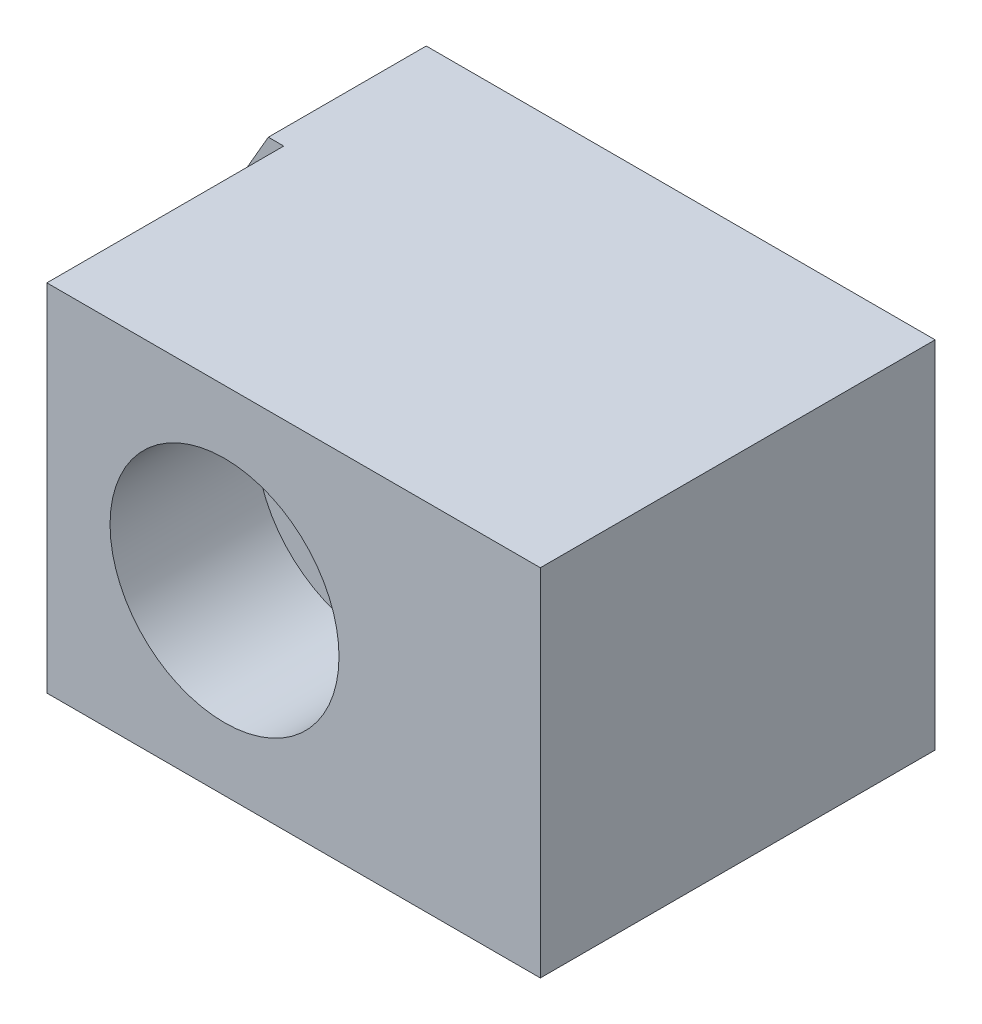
ISO-10303-21;
HEADER;
FILE_DESCRIPTION(('STEP AP214'),'2;1');
FILE_NAME('part.step','',(''),(''),'','','');
FILE_SCHEMA(('AUTOMOTIVE_DESIGN { 1 0 10303 214 1 1 1 1 }'));
ENDSEC;
DATA;
#1=APPLICATION_CONTEXT('core data for automotive mechanical design processes');
#2=APPLICATION_PROTOCOL_DEFINITION('international standard','automotive_design',2000,#1);
#3=PRODUCT_CONTEXT('',#1,'mechanical');
#4=PRODUCT('Part','Part','',(#3));
#5=PRODUCT_RELATED_PRODUCT_CATEGORY('part','',(#4));
#6=PRODUCT_DEFINITION_FORMATION('','',#4);
#7=PRODUCT_DEFINITION_CONTEXT('part definition',#1,'design');
#8=PRODUCT_DEFINITION('design','',#6,#7);
#9=PRODUCT_DEFINITION_SHAPE('','',#8);
#10=(LENGTH_UNIT() NAMED_UNIT(*) SI_UNIT(.MILLI.,.METRE.));
#11=(NAMED_UNIT(*) PLANE_ANGLE_UNIT() SI_UNIT($,.RADIAN.));
#12=(NAMED_UNIT(*) SI_UNIT($,.STERADIAN.) SOLID_ANGLE_UNIT());
#13=UNCERTAINTY_MEASURE_WITH_UNIT(LENGTH_MEASURE(1.E-05),#10,'distance_accuracy_value','');
#14=(GEOMETRIC_REPRESENTATION_CONTEXT(3) GLOBAL_UNCERTAINTY_ASSIGNED_CONTEXT((#13)) GLOBAL_UNIT_ASSIGNED_CONTEXT((#10,
#11,#12)) REPRESENTATION_CONTEXT('',''));
#15=CARTESIAN_POINT('',(0.,0.,0.));
#16=DIRECTION('',(0.,0.,1.));
#17=DIRECTION('',(1.,0.,0.));
#18=AXIS2_PLACEMENT_3D('',#15,#16,#17);
#19=CARTESIAN_POINT('',(-15.2000000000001,0.499999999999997,9.99999999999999));
#20=DIRECTION('',(0.86602540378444,-0.500000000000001,0.));
#21=DIRECTION('',(0.500000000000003,0.866025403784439,0.));
#22=AXIS2_PLACEMENT_3D('',#19,#20,#21);
#23=PLANE('',#22);
#24=DIRECTION('',(-0.500000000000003,-0.866025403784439,0.));
#25=VECTOR('',#24,1.);
#26=CARTESIAN_POINT('',(-12.5000000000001,5.17653718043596,4.));
#27=LINE('',#26,#25);
#28=CARTESIAN_POINT('',(-12.8905989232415,4.49999999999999,4.));
#29=VERTEX_POINT('',#28);
#30=CARTESIAN_POINT('',(-15.2000000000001,0.499999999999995,4.));
#31=VERTEX_POINT('',#30);
#32=EDGE_CURVE('E421',#29,#31,#27,.T.);
#33=ORIENTED_EDGE('',*,*,#32,.F.);
#34=DIRECTION('',(0.,0.,-1.));
#35=VECTOR('',#34,1.);
#36=CARTESIAN_POINT('',(-12.8905989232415,4.5,10.));
#37=LINE('',#36,#35);
#38=CARTESIAN_POINT('',(-12.8905989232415,4.5,0.));
#39=VERTEX_POINT('',#38);
#40=EDGE_CURVE('E442',#29,#39,#37,.T.);
#41=ORIENTED_EDGE('',*,*,#40,.T.);
#42=DIRECTION('',(-0.500000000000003,-0.866025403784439,0.));
#43=VECTOR('',#42,1.);
#44=CARTESIAN_POINT('',(-15.2000000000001,0.499999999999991,0.));
#45=LINE('',#44,#43);
#46=CARTESIAN_POINT('',(-15.2000000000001,0.499999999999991,0.));
#47=VERTEX_POINT('',#46);
#48=EDGE_CURVE('E485',#39,#47,#45,.T.);
#49=ORIENTED_EDGE('',*,*,#48,.T.);
#50=DIRECTION('',(0.,0.,-1.));
#51=VECTOR('',#50,1.);
#52=CARTESIAN_POINT('',(-15.2000000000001,0.499999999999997,9.99999999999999));
#53=LINE('',#52,#51);
#54=EDGE_CURVE('E440',#31,#47,#53,.T.);
#55=ORIENTED_EDGE('',*,*,#54,.F.);
#56=EDGE_LOOP('',(#33,#41,#49,#55));
#57=FACE_BOUND('',#56,.T.);
#58=ADVANCED_FACE('F350',(#57),#23,.F.);
#59=CARTESIAN_POINT('',(-15.2000000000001,-0.500000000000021,10.));
#60=DIRECTION('',(1.,0.,0.));
#61=DIRECTION('',(0.,0.,-1.));
#62=AXIS2_PLACEMENT_3D('',#59,#60,#61);
#63=PLANE('',#62);
#64=DIRECTION('',(0.,-1.,0.));
#65=VECTOR('',#64,1.);
#66=CARTESIAN_POINT('',(-15.2000000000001,0.499999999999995,4.));
#67=LINE('',#66,#65);
#68=CARTESIAN_POINT('',(-15.2000000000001,-0.500000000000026,4.00000000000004));
#69=VERTEX_POINT('',#68);
#70=EDGE_CURVE('E415',#31,#69,#67,.T.);
#71=ORIENTED_EDGE('',*,*,#70,.F.);
#72=ORIENTED_EDGE('',*,*,#54,.T.);
#73=DIRECTION('',(0.,-1.,0.));
#74=VECTOR('',#73,1.);
#75=CARTESIAN_POINT('',(-15.2,-0.500000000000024,0.));
#76=LINE('',#75,#74);
#77=CARTESIAN_POINT('',(-15.2,-0.500000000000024,0.));
#78=VERTEX_POINT('',#77);
#79=EDGE_CURVE('E438',#47,#78,#76,.T.);
#80=ORIENTED_EDGE('',*,*,#79,.T.);
#81=DIRECTION('',(0.,0.,-1.));
#82=VECTOR('',#81,1.);
#83=CARTESIAN_POINT('',(-15.2000000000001,-0.500000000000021,10.));
#84=LINE('',#83,#82);
#85=EDGE_CURVE('E431',#69,#78,#84,.T.);
#86=ORIENTED_EDGE('',*,*,#85,.F.);
#87=EDGE_LOOP('',(#71,#72,#80,#86));
#88=FACE_BOUND('',#87,.T.);
#89=ADVANCED_FACE('F436',(#88),#63,.F.);
#90=CARTESIAN_POINT('',(-12.8905989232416,-4.50000000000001,9.99999999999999));
#91=DIRECTION('',(0.866025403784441,0.500000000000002,0.));
#92=DIRECTION('',(-0.500000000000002,0.866025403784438,0.));
#93=AXIS2_PLACEMENT_3D('',#90,#91,#92);
#94=PLANE('',#93);
#95=DIRECTION('',(0.500000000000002,-0.866025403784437,0.));
#96=VECTOR('',#95,1.);
#97=CARTESIAN_POINT('',(-15.2000000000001,-0.500000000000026,4.00000000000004));
#98=LINE('',#97,#96);
#99=CARTESIAN_POINT('',(-12.8905989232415,-4.50000000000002,4.));
#100=VERTEX_POINT('',#99);
#101=EDGE_CURVE('E418',#69,#100,#98,.T.);
#102=ORIENTED_EDGE('',*,*,#101,.F.);
#103=ORIENTED_EDGE('',*,*,#85,.T.);
#104=DIRECTION('',(0.500000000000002,-0.866025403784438,0.));
#105=VECTOR('',#104,1.);
#106=CARTESIAN_POINT('',(-12.8905989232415,-4.50000000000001,0.));
#107=LINE('',#106,#105);
#108=CARTESIAN_POINT('',(-12.8905989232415,-4.50000000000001,0.));
#109=VERTEX_POINT('',#108);
#110=EDGE_CURVE('E492',#78,#109,#107,.T.);
#111=ORIENTED_EDGE('',*,*,#110,.T.);
#112=DIRECTION('',(0.,0.,-1.));
#113=VECTOR('',#112,1.);
#114=CARTESIAN_POINT('',(-12.8905989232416,-4.50000000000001,9.99999999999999));
#115=LINE('',#114,#113);
#116=EDGE_CURVE('E433',#100,#109,#115,.T.);
#117=ORIENTED_EDGE('',*,*,#116,.F.);
#118=EDGE_LOOP('',(#102,#103,#111,#117));
#119=FACE_BOUND('',#118,.T.);
#120=ADVANCED_FACE('F429',(#119),#94,.F.);
#121=CARTESIAN_POINT('',(0.,-4.49999999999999,9.99999999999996));
#122=DIRECTION('',(-1.,0.,0.));
#123=DIRECTION('',(0.,-1.,0.));
#124=AXIS2_PLACEMENT_3D('',#121,#122,#123);
#125=PLANE('',#124);
#126=DIRECTION('',(0.,1.,0.));
#127=VECTOR('',#126,1.);
#128=CARTESIAN_POINT('',(0.,-4.5,0.));
#129=LINE('',#128,#127);
#130=CARTESIAN_POINT('',(0.,-4.5,0.));
#131=VERTEX_POINT('',#130);
#132=CARTESIAN_POINT('',(0.,4.5,0.));
#133=VERTEX_POINT('',#132);
#134=EDGE_CURVE('E476',#131,#133,#129,.T.);
#135=ORIENTED_EDGE('',*,*,#134,.T.);
#136=DIRECTION('',(0.,0.,-1.));
#137=VECTOR('',#136,1.);
#138=CARTESIAN_POINT('',(0.,4.50000000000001,10.));
#139=LINE('',#138,#137);
#140=CARTESIAN_POINT('',(0.,4.50000000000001,10.));
#141=VERTEX_POINT('',#140);
#142=EDGE_CURVE('E449',#141,#133,#139,.T.);
#143=ORIENTED_EDGE('',*,*,#142,.F.);
#144=DIRECTION('',(0.,1.,0.));
#145=VECTOR('',#144,1.);
#146=CARTESIAN_POINT('',(0.,-4.49999999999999,9.99999999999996));
#147=LINE('',#146,#145);
#148=CARTESIAN_POINT('',(0.,-4.49999999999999,9.99999999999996));
#149=VERTEX_POINT('',#148);
#150=EDGE_CURVE('E465',#149,#141,#147,.T.);
#151=ORIENTED_EDGE('',*,*,#150,.F.);
#152=DIRECTION('',(0.,0.,-1.));
#153=VECTOR('',#152,1.);
#154=CARTESIAN_POINT('',(0.,-4.49999999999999,9.99999999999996));
#155=LINE('',#154,#153);
#156=EDGE_CURVE('E444',#149,#131,#155,.T.);
#157=ORIENTED_EDGE('',*,*,#156,.T.);
#158=EDGE_LOOP('',(#135,#143,#151,#157));
#159=FACE_BOUND('',#158,.T.);
#160=ADVANCED_FACE('F352',(#159),#125,.F.);
#161=CARTESIAN_POINT('',(0.,4.50000000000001,10.));
#162=DIRECTION('',(0.,-1.,0.));
#163=DIRECTION('',(1.,0.,0.));
#164=AXIS2_PLACEMENT_3D('',#161,#162,#163);
#165=PLANE('',#164);
#166=DIRECTION('',(-1.,0.,0.));
#167=VECTOR('',#166,1.);
#168=CARTESIAN_POINT('',(0.,4.5,3.99999999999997));
#169=LINE('',#168,#167);
#170=CARTESIAN_POINT('',(-12.5000000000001,4.5,4.));
#171=VERTEX_POINT('',#170);
#172=EDGE_CURVE('E461',#171,#29,#169,.T.);
#173=ORIENTED_EDGE('',*,*,#172,.F.);
#174=DIRECTION('',(0.,0.,1.));
#175=VECTOR('',#174,1.);
#176=CARTESIAN_POINT('',(-12.5000000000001,4.5,9.99999999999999));
#177=LINE('',#176,#175);
#178=CARTESIAN_POINT('',(-12.5000000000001,4.5,9.99999999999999));
#179=VERTEX_POINT('',#178);
#180=EDGE_CURVE('E453',#171,#179,#177,.T.);
#181=ORIENTED_EDGE('',*,*,#180,.T.);
#182=DIRECTION('',(-1.,0.,0.));
#183=VECTOR('',#182,1.);
#184=CARTESIAN_POINT('',(0.,4.50000000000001,10.));
#185=LINE('',#184,#183);
#186=EDGE_CURVE('E459',#141,#179,#185,.T.);
#187=ORIENTED_EDGE('',*,*,#186,.F.);
#188=ORIENTED_EDGE('',*,*,#142,.T.);
#189=DIRECTION('',(-1.,0.,0.));
#190=VECTOR('',#189,1.);
#191=CARTESIAN_POINT('',(0.,4.5,0.));
#192=LINE('',#191,#190);
#193=EDGE_CURVE('E483',#133,#39,#192,.T.);
#194=ORIENTED_EDGE('',*,*,#193,.T.);
#195=ORIENTED_EDGE('',*,*,#40,.F.);
#196=EDGE_LOOP('',(#173,#181,#187,#188,#194,#195));
#197=FACE_BOUND('',#196,.T.);
#198=ADVANCED_FACE('F458',(#197),#165,.F.);
#199=CARTESIAN_POINT('',(0.,-4.49999999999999,9.99999999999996));
#200=DIRECTION('',(0.,1.,0.));
#201=DIRECTION('',(-1.,0.,0.));
#202=AXIS2_PLACEMENT_3D('',#199,#200,#201);
#203=PLANE('',#202);
#204=DIRECTION('',(1.,0.,0.));
#205=VECTOR('',#204,1.);
#206=CARTESIAN_POINT('',(0.,-4.49999999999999,9.99999999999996));
#207=LINE('',#206,#205);
#208=CARTESIAN_POINT('',(-12.5000000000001,-4.50000000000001,9.99999999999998));
#209=VERTEX_POINT('',#208);
#210=EDGE_CURVE('E372',#209,#149,#207,.T.);
#211=ORIENTED_EDGE('',*,*,#210,.F.);
#212=DIRECTION('',(0.,0.,-1.));
#213=VECTOR('',#212,1.);
#214=CARTESIAN_POINT('',(-12.5000000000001,-4.50000000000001,9.99999999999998));
#215=LINE('',#214,#213);
#216=CARTESIAN_POINT('',(-12.5000000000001,-4.50000000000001,4.));
#217=VERTEX_POINT('',#216);
#218=EDGE_CURVE('E365',#209,#217,#215,.T.);
#219=ORIENTED_EDGE('',*,*,#218,.T.);
#220=DIRECTION('',(1.,0.,0.));
#221=VECTOR('',#220,1.);
#222=CARTESIAN_POINT('',(0.,-4.5,3.99999999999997));
#223=LINE('',#222,#221);
#224=EDGE_CURVE('E11',#100,#217,#223,.T.);
#225=ORIENTED_EDGE('',*,*,#224,.F.);
#226=ORIENTED_EDGE('',*,*,#116,.T.);
#227=DIRECTION('',(1.,0.,0.));
#228=VECTOR('',#227,1.);
#229=CARTESIAN_POINT('',(0.,-4.5,0.));
#230=LINE('',#229,#228);
#231=EDGE_CURVE('E469',#109,#131,#230,.T.);
#232=ORIENTED_EDGE('',*,*,#231,.T.);
#233=ORIENTED_EDGE('',*,*,#156,.F.);
#234=EDGE_LOOP('',(#211,#219,#225,#226,#232,#233));
#235=FACE_BOUND('',#234,.T.);
#236=ADVANCED_FACE('F493',(#235),#203,.F.);
#237=CARTESIAN_POINT('',(0.,4.50000000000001,10.));
#238=DIRECTION('',(0.,0.,1.));
#239=DIRECTION('',(1.,0.,0.));
#240=AXIS2_PLACEMENT_3D('',#237,#238,#239);
#241=PLANE('',#240);
#242=CARTESIAN_POINT('',(-8.00000000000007,0.,10.));
#243=DIRECTION('',(0.,0.,1.));
#244=DIRECTION('',(1.,0.,0.));
#245=AXIS2_PLACEMENT_3D('',#242,#243,#244);
#246=CIRCLE('',#245,2.9);
#247=CARTESIAN_POINT('',(-5.10000000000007,0.,10.));
#248=VERTEX_POINT('',#247);
#249=EDGE_CURVE('E425',#248,#248,#246,.T.);
#250=ORIENTED_EDGE('',*,*,#249,.F.);
#251=EDGE_LOOP('',(#250));
#252=FACE_BOUND('',#251,.T.);
#253=DIRECTION('',(0.,1.,0.));
#254=VECTOR('',#253,1.);
#255=CARTESIAN_POINT('',(-12.5000000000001,4.5,9.99999999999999));
#256=LINE('',#255,#254);
#257=EDGE_CURVE('E358',#209,#179,#256,.T.);
#258=ORIENTED_EDGE('',*,*,#257,.F.);
#259=ORIENTED_EDGE('',*,*,#210,.T.);
#260=ORIENTED_EDGE('',*,*,#150,.T.);
#261=ORIENTED_EDGE('',*,*,#186,.T.);
#262=EDGE_LOOP('',(#258,#259,#260,#261));
#263=FACE_BOUND('',#262,.T.);
#264=ADVANCED_FACE('F463',(#252,#263),#241,.T.);
#265=CARTESIAN_POINT('',(0.,4.5,0.));
#266=DIRECTION('',(0.,0.,1.));
#267=DIRECTION('',(1.,0.,0.));
#268=AXIS2_PLACEMENT_3D('',#265,#266,#267);
#269=PLANE('',#268);
#270=CARTESIAN_POINT('',(-8.00000000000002,0.,0.));
#271=DIRECTION('',(0.,0.,1.));
#272=DIRECTION('',(1.,0.,0.));
#273=AXIS2_PLACEMENT_3D('',#270,#271,#272);
#274=CIRCLE('',#273,1.7);
#275=CARTESIAN_POINT('',(-6.30000000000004,0.,0.));
#276=VERTEX_POINT('',#275);
#277=EDGE_CURVE('E507',#276,#276,#274,.T.);
#278=ORIENTED_EDGE('',*,*,#277,.T.);
#279=EDGE_LOOP('',(#278));
#280=FACE_BOUND('',#279,.T.);
#281=ORIENTED_EDGE('',*,*,#134,.F.);
#282=ORIENTED_EDGE('',*,*,#231,.F.);
#283=ORIENTED_EDGE('',*,*,#110,.F.);
#284=ORIENTED_EDGE('',*,*,#79,.F.);
#285=ORIENTED_EDGE('',*,*,#48,.F.);
#286=ORIENTED_EDGE('',*,*,#193,.F.);
#287=EDGE_LOOP('',(#281,#282,#283,#284,#285,#286));
#288=FACE_BOUND('',#287,.T.);
#289=ADVANCED_FACE('F480',(#280,#288),#269,.F.);
#290=CARTESIAN_POINT('',(-15.2000000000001,-0.500000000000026,4.00000000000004));
#291=DIRECTION('',(0.,0.,1.));
#292=DIRECTION('',(1.,0.,0.));
#293=AXIS2_PLACEMENT_3D('',#290,#291,#292);
#294=PLANE('',#293);
#295=ORIENTED_EDGE('',*,*,#172,.T.);
#296=ORIENTED_EDGE('',*,*,#32,.T.);
#297=ORIENTED_EDGE('',*,*,#70,.T.);
#298=ORIENTED_EDGE('',*,*,#101,.T.);
#299=ORIENTED_EDGE('',*,*,#224,.T.);
#300=DIRECTION('',(0.,1.,0.));
#301=VECTOR('',#300,1.);
#302=CARTESIAN_POINT('',(-12.5000000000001,5.17653718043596,4.));
#303=LINE('',#302,#301);
#304=EDGE_CURVE('E434',#217,#171,#303,.T.);
#305=ORIENTED_EDGE('',*,*,#304,.T.);
#306=EDGE_LOOP('',(#295,#296,#297,#298,#299,#305));
#307=FACE_BOUND('',#306,.T.);
#308=ADVANCED_FACE('F417',(#307),#294,.T.);
#309=CARTESIAN_POINT('',(-12.5000000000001,5.17653718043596,4.));
#310=DIRECTION('',(1.,0.,0.));
#311=DIRECTION('',(0.,1.,0.));
#312=AXIS2_PLACEMENT_3D('',#309,#310,#311);
#313=PLANE('',#312);
#314=ORIENTED_EDGE('',*,*,#304,.F.);
#315=ORIENTED_EDGE('',*,*,#218,.F.);
#316=ORIENTED_EDGE('',*,*,#257,.T.);
#317=ORIENTED_EDGE('',*,*,#180,.F.);
#318=EDGE_LOOP('',(#314,#315,#316,#317));
#319=FACE_BOUND('',#318,.T.);
#320=ADVANCED_FACE('F452',(#319),#313,.F.);
#321=CARTESIAN_POINT('',(-8.00000000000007,0.,10.));
#322=DIRECTION('',(0.,0.,1.));
#323=DIRECTION('',(1.,0.,0.));
#324=AXIS2_PLACEMENT_3D('',#321,#322,#323);
#325=CYLINDRICAL_SURFACE('',#324,2.9);
#326=CARTESIAN_POINT('',(-8.00000000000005,0.,6.30000000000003));
#327=DIRECTION('',(0.,0.,1.));
#328=DIRECTION('',(1.,0.,0.));
#329=AXIS2_PLACEMENT_3D('',#326,#327,#328);
#330=CIRCLE('',#329,2.9);
#331=CARTESIAN_POINT('',(-5.10000000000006,0.,6.30000000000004));
#332=VERTEX_POINT('',#331);
#333=EDGE_CURVE('E501',#332,#332,#330,.T.);
#334=CARTESIAN_POINT('',(-5.10000000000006,0.,6.30000000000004));
#335=CARTESIAN_POINT('',(-5.10000000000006,0.,6.33854166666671));
#336=CARTESIAN_POINT('',(-5.10000000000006,0.,6.37708333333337));
#337=CARTESIAN_POINT('',(-5.10000000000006,0.,6.45416666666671));
#338=CARTESIAN_POINT('',(-5.10000000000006,0.,6.49270833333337));
#339=CARTESIAN_POINT('',(-5.10000000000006,0.,6.56979166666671));
#340=CARTESIAN_POINT('',(-5.10000000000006,0.,6.60833333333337));
#341=CARTESIAN_POINT('',(-5.10000000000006,0.,6.68541666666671));
#342=CARTESIAN_POINT('',(-5.10000000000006,0.,6.72395833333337));
#343=CARTESIAN_POINT('',(-5.10000000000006,0.,6.80104166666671));
#344=CARTESIAN_POINT('',(-5.10000000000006,0.,6.83958333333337));
#345=CARTESIAN_POINT('',(-5.10000000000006,0.,6.91666666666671));
#346=CARTESIAN_POINT('',(-5.10000000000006,0.,6.95520833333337));
#347=CARTESIAN_POINT('',(-5.10000000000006,0.,7.03229166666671));
#348=CARTESIAN_POINT('',(-5.10000000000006,0.,7.07083333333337));
#349=CARTESIAN_POINT('',(-5.10000000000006,0.,7.14791666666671));
#350=CARTESIAN_POINT('',(-5.10000000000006,0.,7.18645833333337));
#351=CARTESIAN_POINT('',(-5.10000000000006,0.,7.26354166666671));
#352=CARTESIAN_POINT('',(-5.10000000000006,0.,7.30208333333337));
#353=CARTESIAN_POINT('',(-5.10000000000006,0.,7.37916666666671));
#354=CARTESIAN_POINT('',(-5.10000000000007,0.,7.41770833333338));
#355=CARTESIAN_POINT('',(-5.10000000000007,0.,7.49479166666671));
#356=CARTESIAN_POINT('',(-5.10000000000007,0.,7.53333333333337));
#357=CARTESIAN_POINT('',(-5.10000000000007,0.,7.61041666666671));
#358=CARTESIAN_POINT('',(-5.10000000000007,0.,7.64895833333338));
#359=CARTESIAN_POINT('',(-5.10000000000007,0.,7.72604166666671));
#360=CARTESIAN_POINT('',(-5.10000000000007,0.,7.76458333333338));
#361=CARTESIAN_POINT('',(-5.10000000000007,0.,7.84166666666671));
#362=CARTESIAN_POINT('',(-5.10000000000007,0.,7.88020833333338));
#363=CARTESIAN_POINT('',(-5.10000000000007,0.,7.95729166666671));
#364=CARTESIAN_POINT('',(-5.10000000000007,0.,7.99583333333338));
#365=CARTESIAN_POINT('',(-5.10000000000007,0.,8.07291666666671));
#366=CARTESIAN_POINT('',(-5.10000000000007,0.,8.11145833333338));
#367=CARTESIAN_POINT('',(-5.10000000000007,0.,8.18854166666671));
#368=CARTESIAN_POINT('',(-5.10000000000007,0.,8.22708333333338));
#369=CARTESIAN_POINT('',(-5.10000000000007,0.,8.30416666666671));
#370=CARTESIAN_POINT('',(-5.10000000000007,0.,8.34270833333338));
#371=CARTESIAN_POINT('',(-5.10000000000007,0.,8.41979166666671));
#372=CARTESIAN_POINT('',(-5.10000000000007,0.,8.45833333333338));
#373=CARTESIAN_POINT('',(-5.10000000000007,0.,8.53541666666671));
#374=CARTESIAN_POINT('',(-5.10000000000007,0.,8.57395833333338));
#375=CARTESIAN_POINT('',(-5.10000000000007,0.,8.65104166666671));
#376=CARTESIAN_POINT('',(-5.10000000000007,0.,8.68958333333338));
#377=CARTESIAN_POINT('',(-5.10000000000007,0.,8.76666666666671));
#378=CARTESIAN_POINT('',(-5.10000000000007,0.,8.80520833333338));
#379=CARTESIAN_POINT('',(-5.10000000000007,0.,8.88229166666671));
#380=CARTESIAN_POINT('',(-5.10000000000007,0.,8.92083333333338));
#381=CARTESIAN_POINT('',(-5.10000000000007,0.,8.99791666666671));
#382=CARTESIAN_POINT('',(-5.10000000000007,0.,9.03645833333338));
#383=CARTESIAN_POINT('',(-5.10000000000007,0.,9.11354166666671));
#384=CARTESIAN_POINT('',(-5.10000000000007,0.,9.15208333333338));
#385=CARTESIAN_POINT('',(-5.10000000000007,0.,9.22916666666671));
#386=CARTESIAN_POINT('',(-5.10000000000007,0.,9.26770833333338));
#387=CARTESIAN_POINT('',(-5.10000000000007,0.,9.34479166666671));
#388=CARTESIAN_POINT('',(-5.10000000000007,0.,9.38333333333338));
#389=CARTESIAN_POINT('',(-5.10000000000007,0.,9.46041666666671));
#390=CARTESIAN_POINT('',(-5.10000000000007,0.,9.49895833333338));
#391=CARTESIAN_POINT('',(-5.10000000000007,0.,9.57604166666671));
#392=CARTESIAN_POINT('',(-5.10000000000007,0.,9.61458333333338));
#393=CARTESIAN_POINT('',(-5.10000000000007,0.,9.69166666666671));
#394=CARTESIAN_POINT('',(-5.10000000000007,0.,9.73020833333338));
#395=CARTESIAN_POINT('',(-5.10000000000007,0.,9.80729166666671));
#396=CARTESIAN_POINT('',(-5.10000000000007,0.,9.84583333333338));
#397=CARTESIAN_POINT('',(-5.10000000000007,0.,9.92291666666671));
#398=CARTESIAN_POINT('',(-5.10000000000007,0.,9.96145833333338));
#399=CARTESIAN_POINT('',(-5.10000000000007,0.,10.));
#400=B_SPLINE_CURVE_WITH_KNOTS('',3,(#334,#335,#336,#337,#338,#339,#340,#341,#342,#343,#344,
#345,#346,#347,#348,#349,#350,#351,#352,#353,#354,#355,#356,#357,#358,#359,#360,#361,#362,#363,
#364,#365,#366,#367,#368,#369,#370,#371,#372,#373,#374,#375,#376,#377,#378,#379,#380,#381,#382,
#383,#384,#385,#386,#387,#388,#389,#390,#391,#392,#393,#394,#395,#396,#397,#398,#399),
.UNSPECIFIED.,.F.,.F.,(4,2,2,2,2,2,2,2,2,2,2,2,2,2,2,2,2,2,2,2,2,2,2,2,2,2,2,2,2,2,2,2,4),(0.,
0.115625,0.231250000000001,0.346875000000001,0.4625,0.578125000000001,0.693750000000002,
0.809375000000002,0.925000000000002,1.040625,1.15625,1.271875,1.3875,1.503125,1.61875,1.734375,
1.85,1.965625,2.08125,2.19687500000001,2.3125,2.42812500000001,2.54375000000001,
2.65937500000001,2.77500000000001,2.89062500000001,3.00625000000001,3.12187500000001,
3.23750000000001,3.35312500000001,3.46875000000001,3.58437500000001,3.70000000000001),.UNSPECIFIED.);
#401=EDGE_CURVE('BSEAM521',#332,#248,#400,.T.);
#402=ORIENTED_EDGE('',*,*,#333,.F.);
#403=ORIENTED_EDGE('',*,*,#249,.T.);
#404=ORIENTED_EDGE('',*,*,#401,.T.);
#405=ORIENTED_EDGE('',*,*,#401,.F.);
#406=EDGE_LOOP('',(#402,#404,#403,#405));
#407=FACE_BOUND('',#406,.T.);
#408=ADVANCED_FACE('F521',(#407),#325,.F.);
#409=CARTESIAN_POINT('',(-6.30000000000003,0.,6.30000000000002));
#410=DIRECTION('',(0.,0.,-1.));
#411=DIRECTION('',(-1.,0.,0.));
#412=AXIS2_PLACEMENT_3D('',#409,#410,#411);
#413=PLANE('',#412);
#414=CARTESIAN_POINT('',(-8.00000000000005,0.,6.30000000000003));
#415=DIRECTION('',(0.,0.,1.));
#416=DIRECTION('',(1.,0.,0.));
#417=AXIS2_PLACEMENT_3D('',#414,#415,#416);
#418=CIRCLE('',#417,1.70000000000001);
#419=CARTESIAN_POINT('',(-6.30000000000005,0.,6.30000000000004));
#420=VERTEX_POINT('',#419);
#421=EDGE_CURVE('E504',#420,#420,#418,.T.);
#422=ORIENTED_EDGE('',*,*,#421,.F.);
#423=EDGE_LOOP('',(#422));
#424=FACE_BOUND('',#423,.T.);
#425=ORIENTED_EDGE('',*,*,#333,.T.);
#426=EDGE_LOOP('',(#425));
#427=FACE_BOUND('',#426,.T.);
#428=ADVANCED_FACE('F515',(#424,#427),#413,.F.);
#429=CARTESIAN_POINT('',(-8.00000000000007,0.,10.));
#430=DIRECTION('',(0.,0.,1.));
#431=DIRECTION('',(1.,0.,0.));
#432=AXIS2_PLACEMENT_3D('',#429,#430,#431);
#433=CYLINDRICAL_SURFACE('',#432,1.70000000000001);
#434=CARTESIAN_POINT('',(-6.30000000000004,0.,0.));
#435=CARTESIAN_POINT('',(-6.30000000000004,0.,0.0656250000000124));
#436=CARTESIAN_POINT('',(-6.30000000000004,0.,0.131250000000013));
#437=CARTESIAN_POINT('',(-6.30000000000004,0.,0.262500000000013));
#438=CARTESIAN_POINT('',(-6.30000000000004,0.,0.328125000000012));
#439=CARTESIAN_POINT('',(-6.30000000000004,0.,0.459375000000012));
#440=CARTESIAN_POINT('',(-6.30000000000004,0.,0.525000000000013));
#441=CARTESIAN_POINT('',(-6.30000000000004,0.,0.656250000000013));
#442=CARTESIAN_POINT('',(-6.30000000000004,0.,0.721875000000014));
#443=CARTESIAN_POINT('',(-6.30000000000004,0.,0.853125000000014));
#444=CARTESIAN_POINT('',(-6.30000000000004,0.,0.918750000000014));
#445=CARTESIAN_POINT('',(-6.30000000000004,0.,1.05000000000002));
#446=CARTESIAN_POINT('',(-6.30000000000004,0.,1.11562500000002));
#447=CARTESIAN_POINT('',(-6.30000000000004,0.,1.24687500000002));
#448=CARTESIAN_POINT('',(-6.30000000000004,0.,1.31250000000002));
#449=CARTESIAN_POINT('',(-6.30000000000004,0.,1.44375000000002));
#450=CARTESIAN_POINT('',(-6.30000000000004,0.,1.50937500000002));
#451=CARTESIAN_POINT('',(-6.30000000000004,0.,1.64062500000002));
#452=CARTESIAN_POINT('',(-6.30000000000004,0.,1.70625000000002));
#453=CARTESIAN_POINT('',(-6.30000000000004,0.,1.83750000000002));
#454=CARTESIAN_POINT('',(-6.30000000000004,0.,1.90312500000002));
#455=CARTESIAN_POINT('',(-6.30000000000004,0.,2.03437500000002));
#456=CARTESIAN_POINT('',(-6.30000000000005,0.,2.10000000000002));
#457=CARTESIAN_POINT('',(-6.30000000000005,0.,2.23125000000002));
#458=CARTESIAN_POINT('',(-6.30000000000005,0.,2.29687500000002));
#459=CARTESIAN_POINT('',(-6.30000000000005,0.,2.42812500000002));
#460=CARTESIAN_POINT('',(-6.30000000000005,0.,2.49375000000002));
#461=CARTESIAN_POINT('',(-6.30000000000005,0.,2.62500000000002));
#462=CARTESIAN_POINT('',(-6.30000000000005,0.,2.69062500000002));
#463=CARTESIAN_POINT('',(-6.30000000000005,0.,2.82187500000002));
#464=CARTESIAN_POINT('',(-6.30000000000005,0.,2.88750000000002));
#465=CARTESIAN_POINT('',(-6.30000000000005,0.,3.01875000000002));
#466=CARTESIAN_POINT('',(-6.30000000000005,0.,3.08437500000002));
#467=CARTESIAN_POINT('',(-6.30000000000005,0.,3.21562500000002));
#468=CARTESIAN_POINT('',(-6.30000000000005,0.,3.28125000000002));
#469=CARTESIAN_POINT('',(-6.30000000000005,0.,3.41250000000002));
#470=CARTESIAN_POINT('',(-6.30000000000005,0.,3.47812500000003));
#471=CARTESIAN_POINT('',(-6.30000000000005,0.,3.60937500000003));
#472=CARTESIAN_POINT('',(-6.30000000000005,0.,3.67500000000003));
#473=CARTESIAN_POINT('',(-6.30000000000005,0.,3.80625000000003));
#474=CARTESIAN_POINT('',(-6.30000000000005,0.,3.87187500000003));
#475=CARTESIAN_POINT('',(-6.30000000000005,0.,4.00312500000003));
#476=CARTESIAN_POINT('',(-6.30000000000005,0.,4.06875000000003));
#477=CARTESIAN_POINT('',(-6.30000000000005,0.,4.20000000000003));
#478=CARTESIAN_POINT('',(-6.30000000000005,0.,4.26562500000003));
#479=CARTESIAN_POINT('',(-6.30000000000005,0.,4.39687500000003));
#480=CARTESIAN_POINT('',(-6.30000000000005,0.,4.46250000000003));
#481=CARTESIAN_POINT('',(-6.30000000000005,0.,4.59375000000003));
#482=CARTESIAN_POINT('',(-6.30000000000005,0.,4.65937500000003));
#483=CARTESIAN_POINT('',(-6.30000000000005,0.,4.79062500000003));
#484=CARTESIAN_POINT('',(-6.30000000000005,0.,4.85625000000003));
#485=CARTESIAN_POINT('',(-6.30000000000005,0.,4.98750000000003));
#486=CARTESIAN_POINT('',(-6.30000000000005,0.,5.05312500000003));
#487=CARTESIAN_POINT('',(-6.30000000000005,0.,5.18437500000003));
#488=CARTESIAN_POINT('',(-6.30000000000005,0.,5.25000000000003));
#489=CARTESIAN_POINT('',(-6.30000000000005,0.,5.38125000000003));
#490=CARTESIAN_POINT('',(-6.30000000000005,0.,5.44687500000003));
#491=CARTESIAN_POINT('',(-6.30000000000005,0.,5.57812500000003));
#492=CARTESIAN_POINT('',(-6.30000000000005,0.,5.64375000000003));
#493=CARTESIAN_POINT('',(-6.30000000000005,0.,5.77500000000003));
#494=CARTESIAN_POINT('',(-6.30000000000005,0.,5.84062500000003));
#495=CARTESIAN_POINT('',(-6.30000000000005,0.,5.97187500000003));
#496=CARTESIAN_POINT('',(-6.30000000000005,0.,6.03750000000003));
#497=CARTESIAN_POINT('',(-6.30000000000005,0.,6.16875000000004));
#498=CARTESIAN_POINT('',(-6.30000000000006,0.,6.23437500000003));
#499=CARTESIAN_POINT('',(-6.30000000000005,0.,6.30000000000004));
#500=B_SPLINE_CURVE_WITH_KNOTS('',3,(#434,#435,#436,#437,#438,#439,#440,#441,#442,#443,#444,
#445,#446,#447,#448,#449,#450,#451,#452,#453,#454,#455,#456,#457,#458,#459,#460,#461,#462,#463,
#464,#465,#466,#467,#468,#469,#470,#471,#472,#473,#474,#475,#476,#477,#478,#479,#480,#481,#482,
#483,#484,#485,#486,#487,#488,#489,#490,#491,#492,#493,#494,#495,#496,#497,#498,#499),
.UNSPECIFIED.,.F.,.F.,(4,2,2,2,2,2,2,2,2,2,2,2,2,2,2,2,2,2,2,2,2,2,2,2,2,2,2,2,2,2,2,2,4),(0.,
0.196875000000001,0.39375,0.590625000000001,0.787500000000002,0.984375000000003,1.18125,
1.378125,1.57500000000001,1.77187500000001,1.96875000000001,2.16562500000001,2.36250000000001,
2.55937500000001,2.75625000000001,2.95312500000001,3.15000000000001,3.34687500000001,
3.54375000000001,3.74062500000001,3.93750000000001,4.13437500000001,4.33125000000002,
4.52812500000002,4.72500000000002,4.92187500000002,5.11875000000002,5.31562500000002,
5.51250000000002,5.70937500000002,5.90625000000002,6.10312500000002,6.30000000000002),.UNSPECIFIED.);
#501=EDGE_CURVE('BSEAM512',#276,#420,#500,.T.);
#502=ORIENTED_EDGE('',*,*,#277,.F.);
#503=ORIENTED_EDGE('',*,*,#421,.T.);
#504=ORIENTED_EDGE('',*,*,#501,.T.);
#505=ORIENTED_EDGE('',*,*,#501,.F.);
#506=EDGE_LOOP('',(#502,#504,#503,#505));
#507=FACE_BOUND('',#506,.T.);
#508=ADVANCED_FACE('F512',(#507),#433,.F.);
#509=CLOSED_SHELL('',(#58,#89,#120,#160,#198,#236,#264,#289,#308,#320,#408,#428,#508));
#510=MANIFOLD_SOLID_BREP('B2',#509);
#511=ADVANCED_BREP_SHAPE_REPRESENTATION('',(#18,#510),#14);
#512=SHAPE_DEFINITION_REPRESENTATION(#9,#511);
ENDSEC;
END-ISO-10303-21;
